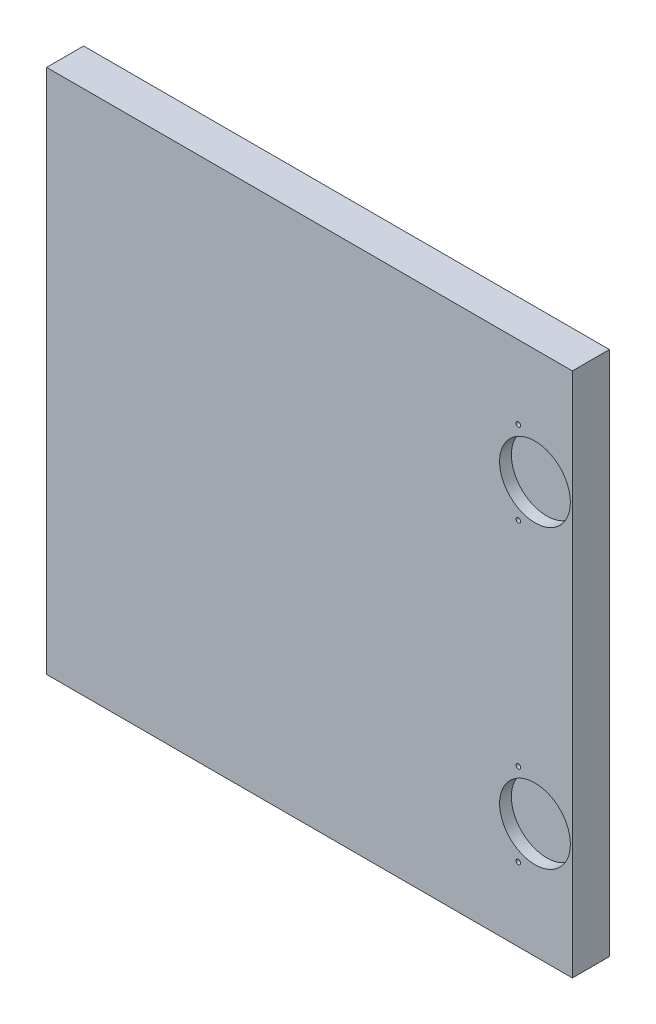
ISO-10303-21;
HEADER;
FILE_DESCRIPTION(('STEP AP214'),'2;1');
FILE_NAME('part.step','',(''),(''),'','','');
FILE_SCHEMA(('AUTOMOTIVE_DESIGN { 1 0 10303 214 1 1 1 1 }'));
ENDSEC;
DATA;
#1=APPLICATION_CONTEXT('core data for automotive mechanical design processes');
#2=APPLICATION_PROTOCOL_DEFINITION('international standard','automotive_design',2000,#1);
#3=PRODUCT_CONTEXT('',#1,'mechanical');
#4=PRODUCT('Part','Part','',(#3));
#5=PRODUCT_RELATED_PRODUCT_CATEGORY('part','',(#4));
#6=PRODUCT_DEFINITION_FORMATION('','',#4);
#7=PRODUCT_DEFINITION_CONTEXT('part definition',#1,'design');
#8=PRODUCT_DEFINITION('design','',#6,#7);
#9=PRODUCT_DEFINITION_SHAPE('','',#8);
#10=(LENGTH_UNIT() NAMED_UNIT(*) SI_UNIT(.MILLI.,.METRE.));
#11=(NAMED_UNIT(*) PLANE_ANGLE_UNIT() SI_UNIT($,.RADIAN.));
#12=(NAMED_UNIT(*) SI_UNIT($,.STERADIAN.) SOLID_ANGLE_UNIT());
#13=UNCERTAINTY_MEASURE_WITH_UNIT(LENGTH_MEASURE(1.E-05),#10,'distance_accuracy_value','');
#14=(GEOMETRIC_REPRESENTATION_CONTEXT(3) GLOBAL_UNCERTAINTY_ASSIGNED_CONTEXT((#13)) GLOBAL_UNIT_ASSIGNED_CONTEXT((#10,
#11,#12)) REPRESENTATION_CONTEXT('',''));
#15=CARTESIAN_POINT('',(0.,0.,0.));
#16=DIRECTION('',(0.,0.,1.));
#17=DIRECTION('',(1.,0.,0.));
#18=AXIS2_PLACEMENT_3D('',#15,#16,#17);
#19=CARTESIAN_POINT('',(0.,0.,0.));
#20=DIRECTION('',(0.,0.,-1.));
#21=DIRECTION('',(-1.,0.,0.));
#22=AXIS2_PLACEMENT_3D('',#19,#20,#21);
#23=PLANE('',#22);
#24=CARTESIAN_POINT('',(121.86,80.,0.));
#25=DIRECTION('',(0.,0.,1.));
#26=DIRECTION('',(1.,0.,0.));
#27=AXIS2_PLACEMENT_3D('',#24,#25,#26);
#28=CIRCLE('',#27,19.125);
#29=CARTESIAN_POINT('',(140.985,80.,0.));
#30=VERTEX_POINT('',#29);
#31=EDGE_CURVE('E39',#30,#30,#28,.T.);
#32=ORIENTED_EDGE('',*,*,#31,.F.);
#33=EDGE_LOOP('',(#32));
#34=FACE_BOUND('',#33,.T.);
#35=CARTESIAN_POINT('',(112.86,57.5765625,0.));
#36=DIRECTION('',(0.,0.,1.));
#37=DIRECTION('',(1.,0.,0.));
#38=AXIS2_PLACEMENT_3D('',#35,#36,#37);
#39=CIRCLE('',#38,1.25);
#40=CARTESIAN_POINT('',(114.11,57.5765625,0.));
#41=VERTEX_POINT('',#40);
#42=EDGE_CURVE('E127',#41,#41,#39,.T.);
#43=ORIENTED_EDGE('',*,*,#42,.F.);
#44=EDGE_LOOP('',(#43));
#45=FACE_BOUND('',#44,.T.);
#46=CARTESIAN_POINT('',(112.86,102.4234375,0.));
#47=DIRECTION('',(0.,0.,1.));
#48=DIRECTION('',(1.,0.,0.));
#49=AXIS2_PLACEMENT_3D('',#46,#47,#48);
#50=CIRCLE('',#49,1.25);
#51=CARTESIAN_POINT('',(114.11,102.4234375,0.));
#52=VERTEX_POINT('',#51);
#53=EDGE_CURVE('E131',#52,#52,#50,.T.);
#54=ORIENTED_EDGE('',*,*,#53,.F.);
#55=EDGE_LOOP('',(#54));
#56=FACE_BOUND('',#55,.T.);
#57=CARTESIAN_POINT('',(121.86,-80.,0.));
#58=DIRECTION('',(0.,0.,-1.));
#59=DIRECTION('',(1.,0.,0.));
#60=AXIS2_PLACEMENT_3D('',#57,#58,#59);
#61=CIRCLE('',#60,19.125);
#62=CARTESIAN_POINT('',(140.985,-80.,0.));
#63=VERTEX_POINT('',#62);
#64=EDGE_CURVE('E121',#63,#63,#61,.T.);
#65=ORIENTED_EDGE('',*,*,#64,.T.);
#66=EDGE_LOOP('',(#65));
#67=FACE_BOUND('',#66,.T.);
#68=CARTESIAN_POINT('',(112.86,-102.4234375,0.));
#69=DIRECTION('',(0.,0.,-1.));
#70=DIRECTION('',(1.,0.,0.));
#71=AXIS2_PLACEMENT_3D('',#68,#69,#70);
#72=CIRCLE('',#71,1.25);
#73=CARTESIAN_POINT('',(114.11,-102.4234375,0.));
#74=VERTEX_POINT('',#73);
#75=EDGE_CURVE('E115',#74,#74,#72,.T.);
#76=ORIENTED_EDGE('',*,*,#75,.T.);
#77=EDGE_LOOP('',(#76));
#78=FACE_BOUND('',#77,.T.);
#79=CARTESIAN_POINT('',(112.86,-57.5765625,0.));
#80=DIRECTION('',(0.,0.,-1.));
#81=DIRECTION('',(1.,0.,0.));
#82=AXIS2_PLACEMENT_3D('',#79,#80,#81);
#83=CIRCLE('',#82,1.25);
#84=CARTESIAN_POINT('',(114.11,-57.5765625,0.));
#85=VERTEX_POINT('',#84);
#86=EDGE_CURVE('E107',#85,#85,#83,.T.);
#87=ORIENTED_EDGE('',*,*,#86,.T.);
#88=EDGE_LOOP('',(#87));
#89=FACE_BOUND('',#88,.T.);
#90=DIRECTION('',(0.,1.,0.));
#91=VECTOR('',#90,1.);
#92=CARTESIAN_POINT('',(-142.0625,-142.0625,0.));
#93=LINE('',#92,#91);
#94=CARTESIAN_POINT('',(-142.0625,-142.0625,0.));
#95=VERTEX_POINT('',#94);
#96=CARTESIAN_POINT('',(-142.0625,142.0625,0.));
#97=VERTEX_POINT('',#96);
#98=EDGE_CURVE('E58',#95,#97,#93,.T.);
#99=ORIENTED_EDGE('',*,*,#98,.F.);
#100=DIRECTION('',(-1.,0.,0.));
#101=VECTOR('',#100,1.);
#102=CARTESIAN_POINT('',(142.0625,-142.0625,0.));
#103=LINE('',#102,#101);
#104=CARTESIAN_POINT('',(142.0625,-142.0625,0.));
#105=VERTEX_POINT('',#104);
#106=EDGE_CURVE('E80',#105,#95,#103,.T.);
#107=ORIENTED_EDGE('',*,*,#106,.F.);
#108=DIRECTION('',(0.,-1.,0.));
#109=VECTOR('',#108,1.);
#110=CARTESIAN_POINT('',(142.0625,142.0625,0.));
#111=LINE('',#110,#109);
#112=CARTESIAN_POINT('',(142.0625,142.0625,0.));
#113=VERTEX_POINT('',#112);
#114=EDGE_CURVE('E87',#113,#105,#111,.T.);
#115=ORIENTED_EDGE('',*,*,#114,.F.);
#116=DIRECTION('',(1.,0.,0.));
#117=VECTOR('',#116,1.);
#118=CARTESIAN_POINT('',(-142.0625,142.0625,0.));
#119=LINE('',#118,#117);
#120=EDGE_CURVE('E92',#97,#113,#119,.T.);
#121=ORIENTED_EDGE('',*,*,#120,.F.);
#122=EDGE_LOOP('',(#99,#107,#115,#121));
#123=FACE_BOUND('',#122,.T.);
#124=ADVANCED_FACE('F36',(#34,#45,#56,#67,#78,#89,#123),#23,.F.);
#125=CARTESIAN_POINT('',(121.86,80.,-6.35));
#126=DIRECTION('',(0.,0.,1.));
#127=DIRECTION('',(1.,0.,0.));
#128=AXIS2_PLACEMENT_3D('',#125,#126,#127);
#129=CYLINDRICAL_SURFACE('',#128,19.125);
#130=CARTESIAN_POINT('',(121.86,80.,-6.35));
#131=DIRECTION('',(0.,0.,1.));
#132=DIRECTION('',(1.,0.,0.));
#133=AXIS2_PLACEMENT_3D('',#130,#131,#132);
#134=CIRCLE('',#133,19.125);
#135=CARTESIAN_POINT('',(140.985,80.,-6.35));
#136=VERTEX_POINT('',#135);
#137=EDGE_CURVE('E12',#136,#136,#134,.T.);
#138=ORIENTED_EDGE('',*,*,#137,.F.);
#139=EDGE_LOOP('',(#138));
#140=FACE_BOUND('',#139,.T.);
#141=ORIENTED_EDGE('',*,*,#31,.T.);
#142=EDGE_LOOP('',(#141));
#143=FACE_BOUND('',#142,.T.);
#144=ADVANCED_FACE('F144',(#140,#143),#129,.F.);
#145=CARTESIAN_POINT('',(121.86,80.,-6.35));
#146=DIRECTION('',(0.,0.,1.));
#147=DIRECTION('',(1.,0.,0.));
#148=AXIS2_PLACEMENT_3D('',#145,#146,#147);
#149=PLANE('',#148);
#150=ORIENTED_EDGE('',*,*,#137,.T.);
#151=EDGE_LOOP('',(#150));
#152=FACE_BOUND('',#151,.T.);
#153=ADVANCED_FACE('F197',(#152),#149,.T.);
#154=CARTESIAN_POINT('',(112.86,57.5765625,-10.));
#155=DIRECTION('',(0.,0.,1.));
#156=DIRECTION('',(1.,0.,0.));
#157=AXIS2_PLACEMENT_3D('',#154,#155,#156);
#158=CYLINDRICAL_SURFACE('',#157,1.25);
#159=CARTESIAN_POINT('',(112.86,57.5765625,-10.));
#160=DIRECTION('',(0.,0.,1.));
#161=DIRECTION('',(1.,0.,0.));
#162=AXIS2_PLACEMENT_3D('',#159,#160,#161);
#163=CIRCLE('',#162,1.25);
#164=CARTESIAN_POINT('',(114.11,57.5765625,-10.));
#165=VERTEX_POINT('',#164);
#166=EDGE_CURVE('E134',#165,#165,#163,.T.);
#167=ORIENTED_EDGE('',*,*,#166,.F.);
#168=EDGE_LOOP('',(#167));
#169=FACE_BOUND('',#168,.T.);
#170=ORIENTED_EDGE('',*,*,#42,.T.);
#171=EDGE_LOOP('',(#170));
#172=FACE_BOUND('',#171,.T.);
#173=ADVANCED_FACE('F140',(#169,#172),#158,.F.);
#174=CARTESIAN_POINT('',(112.86,57.5765625,-10.));
#175=DIRECTION('',(0.,0.,1.));
#176=DIRECTION('',(1.,0.,0.));
#177=AXIS2_PLACEMENT_3D('',#174,#175,#176);
#178=PLANE('',#177);
#179=ORIENTED_EDGE('',*,*,#166,.T.);
#180=EDGE_LOOP('',(#179));
#181=FACE_BOUND('',#180,.T.);
#182=ADVANCED_FACE('F190',(#181),#178,.T.);
#183=CARTESIAN_POINT('',(112.86,102.4234375,-10.));
#184=DIRECTION('',(0.,0.,1.));
#185=DIRECTION('',(1.,0.,0.));
#186=AXIS2_PLACEMENT_3D('',#183,#184,#185);
#187=CYLINDRICAL_SURFACE('',#186,1.25);
#188=CARTESIAN_POINT('',(112.86,102.4234375,-10.));
#189=DIRECTION('',(0.,0.,1.));
#190=DIRECTION('',(1.,0.,0.));
#191=AXIS2_PLACEMENT_3D('',#188,#189,#190);
#192=CIRCLE('',#191,1.25);
#193=CARTESIAN_POINT('',(114.11,102.4234375,-10.));
#194=VERTEX_POINT('',#193);
#195=EDGE_CURVE('E128',#194,#194,#192,.T.);
#196=ORIENTED_EDGE('',*,*,#195,.F.);
#197=EDGE_LOOP('',(#196));
#198=FACE_BOUND('',#197,.T.);
#199=ORIENTED_EDGE('',*,*,#53,.T.);
#200=EDGE_LOOP('',(#199));
#201=FACE_BOUND('',#200,.T.);
#202=ADVANCED_FACE('F186',(#198,#201),#187,.F.);
#203=CARTESIAN_POINT('',(112.86,102.4234375,-10.));
#204=DIRECTION('',(0.,0.,1.));
#205=DIRECTION('',(1.,0.,0.));
#206=AXIS2_PLACEMENT_3D('',#203,#204,#205);
#207=PLANE('',#206);
#208=ORIENTED_EDGE('',*,*,#195,.T.);
#209=EDGE_LOOP('',(#208));
#210=FACE_BOUND('',#209,.T.);
#211=ADVANCED_FACE('F182',(#210),#207,.T.);
#212=CARTESIAN_POINT('',(121.86,-80.,-6.35));
#213=DIRECTION('',(0.,0.,1.));
#214=DIRECTION('',(1.,0.,0.));
#215=AXIS2_PLACEMENT_3D('',#212,#213,#214);
#216=CYLINDRICAL_SURFACE('',#215,19.125);
#217=CARTESIAN_POINT('',(121.86,-80.,-6.35));
#218=DIRECTION('',(0.,0.,-1.));
#219=DIRECTION('',(1.,0.,0.));
#220=AXIS2_PLACEMENT_3D('',#217,#218,#219);
#221=CIRCLE('',#220,19.125);
#222=CARTESIAN_POINT('',(140.985,-80.,-6.35));
#223=VERTEX_POINT('',#222);
#224=EDGE_CURVE('E124',#223,#223,#221,.T.);
#225=ORIENTED_EDGE('',*,*,#224,.T.);
#226=EDGE_LOOP('',(#225));
#227=FACE_BOUND('',#226,.T.);
#228=ORIENTED_EDGE('',*,*,#64,.F.);
#229=EDGE_LOOP('',(#228));
#230=FACE_BOUND('',#229,.T.);
#231=ADVANCED_FACE('F178',(#227,#230),#216,.F.);
#232=CARTESIAN_POINT('',(121.86,-80.,-6.35));
#233=DIRECTION('',(0.,0.,1.));
#234=DIRECTION('',(1.,0.,0.));
#235=AXIS2_PLACEMENT_3D('',#232,#233,#234);
#236=PLANE('',#235);
#237=ORIENTED_EDGE('',*,*,#224,.F.);
#238=EDGE_LOOP('',(#237));
#239=FACE_BOUND('',#238,.T.);
#240=ADVANCED_FACE('F174',(#239),#236,.T.);
#241=CARTESIAN_POINT('',(112.86,-102.4234375,-10.));
#242=DIRECTION('',(0.,0.,1.));
#243=DIRECTION('',(1.,0.,0.));
#244=AXIS2_PLACEMENT_3D('',#241,#242,#243);
#245=CYLINDRICAL_SURFACE('',#244,1.25);
#246=CARTESIAN_POINT('',(112.86,-102.4234375,-10.));
#247=DIRECTION('',(0.,0.,-1.));
#248=DIRECTION('',(1.,0.,0.));
#249=AXIS2_PLACEMENT_3D('',#246,#247,#248);
#250=CIRCLE('',#249,1.25);
#251=CARTESIAN_POINT('',(114.11,-102.4234375,-10.));
#252=VERTEX_POINT('',#251);
#253=EDGE_CURVE('E118',#252,#252,#250,.T.);
#254=ORIENTED_EDGE('',*,*,#253,.T.);
#255=EDGE_LOOP('',(#254));
#256=FACE_BOUND('',#255,.T.);
#257=ORIENTED_EDGE('',*,*,#75,.F.);
#258=EDGE_LOOP('',(#257));
#259=FACE_BOUND('',#258,.T.);
#260=ADVANCED_FACE('F167',(#256,#259),#245,.F.);
#261=CARTESIAN_POINT('',(112.86,-102.4234375,-10.));
#262=DIRECTION('',(0.,0.,1.));
#263=DIRECTION('',(1.,0.,0.));
#264=AXIS2_PLACEMENT_3D('',#261,#262,#263);
#265=PLANE('',#264);
#266=ORIENTED_EDGE('',*,*,#253,.F.);
#267=EDGE_LOOP('',(#266));
#268=FACE_BOUND('',#267,.T.);
#269=ADVANCED_FACE('F157',(#268),#265,.T.);
#270=CARTESIAN_POINT('',(112.86,-57.5765625,-10.));
#271=DIRECTION('',(0.,0.,1.));
#272=DIRECTION('',(1.,0.,0.));
#273=AXIS2_PLACEMENT_3D('',#270,#271,#272);
#274=CYLINDRICAL_SURFACE('',#273,1.25);
#275=CARTESIAN_POINT('',(112.86,-57.5765625,-10.));
#276=DIRECTION('',(0.,0.,-1.));
#277=DIRECTION('',(1.,0.,0.));
#278=AXIS2_PLACEMENT_3D('',#275,#276,#277);
#279=CIRCLE('',#278,1.25);
#280=CARTESIAN_POINT('',(114.11,-57.5765625,-10.));
#281=VERTEX_POINT('',#280);
#282=EDGE_CURVE('E112',#281,#281,#279,.T.);
#283=ORIENTED_EDGE('',*,*,#282,.T.);
#284=EDGE_LOOP('',(#283));
#285=FACE_BOUND('',#284,.T.);
#286=ORIENTED_EDGE('',*,*,#86,.F.);
#287=EDGE_LOOP('',(#286));
#288=FACE_BOUND('',#287,.T.);
#289=ADVANCED_FACE('F154',(#285,#288),#274,.F.);
#290=CARTESIAN_POINT('',(112.86,-57.5765625,-10.));
#291=DIRECTION('',(0.,0.,1.));
#292=DIRECTION('',(1.,0.,0.));
#293=AXIS2_PLACEMENT_3D('',#290,#291,#292);
#294=PLANE('',#293);
#295=ORIENTED_EDGE('',*,*,#282,.F.);
#296=EDGE_LOOP('',(#295));
#297=FACE_BOUND('',#296,.T.);
#298=ADVANCED_FACE('F156',(#297),#294,.T.);
#299=CARTESIAN_POINT('',(-142.0625,-142.0625,0.));
#300=DIRECTION('',(-1.,0.,0.));
#301=DIRECTION('',(0.,0.,1.));
#302=AXIS2_PLACEMENT_3D('',#299,#300,#301);
#303=PLANE('',#302);
#304=DIRECTION('',(0.,1.,0.));
#305=VECTOR('',#304,1.);
#306=CARTESIAN_POINT('',(-142.0625,-142.0625,-20.));
#307=LINE('',#306,#305);
#308=CARTESIAN_POINT('',(-142.0625,-142.0625,-20.));
#309=VERTEX_POINT('',#308);
#310=CARTESIAN_POINT('',(-142.0625,142.0625,-20.));
#311=VERTEX_POINT('',#310);
#312=EDGE_CURVE('E99',#309,#311,#307,.T.);
#313=ORIENTED_EDGE('',*,*,#312,.F.);
#314=DIRECTION('',(0.,0.,-1.));
#315=VECTOR('',#314,1.);
#316=CARTESIAN_POINT('',(-142.0625,-142.0625,0.));
#317=LINE('',#316,#315);
#318=EDGE_CURVE('E83',#95,#309,#317,.T.);
#319=ORIENTED_EDGE('',*,*,#318,.F.);
#320=ORIENTED_EDGE('',*,*,#98,.T.);
#321=DIRECTION('',(0.,0.,-1.));
#322=VECTOR('',#321,1.);
#323=CARTESIAN_POINT('',(-142.0625,142.0625,0.));
#324=LINE('',#323,#322);
#325=EDGE_CURVE('E94',#97,#311,#324,.T.);
#326=ORIENTED_EDGE('',*,*,#325,.T.);
#327=EDGE_LOOP('',(#313,#319,#320,#326));
#328=FACE_BOUND('',#327,.T.);
#329=ADVANCED_FACE('F164',(#328),#303,.T.);
#330=CARTESIAN_POINT('',(142.0625,-142.0625,0.));
#331=DIRECTION('',(0.,-1.,0.));
#332=DIRECTION('',(0.,0.,-1.));
#333=AXIS2_PLACEMENT_3D('',#330,#331,#332);
#334=PLANE('',#333);
#335=DIRECTION('',(-1.,0.,0.));
#336=VECTOR('',#335,1.);
#337=CARTESIAN_POINT('',(142.0625,-142.0625,-20.));
#338=LINE('',#337,#336);
#339=CARTESIAN_POINT('',(142.0625,-142.0625,-20.));
#340=VERTEX_POINT('',#339);
#341=EDGE_CURVE('E82',#340,#309,#338,.T.);
#342=ORIENTED_EDGE('',*,*,#341,.F.);
#343=DIRECTION('',(0.,0.,-1.));
#344=VECTOR('',#343,1.);
#345=CARTESIAN_POINT('',(142.0625,-142.0625,0.));
#346=LINE('',#345,#344);
#347=EDGE_CURVE('E76',#105,#340,#346,.T.);
#348=ORIENTED_EDGE('',*,*,#347,.F.);
#349=ORIENTED_EDGE('',*,*,#106,.T.);
#350=ORIENTED_EDGE('',*,*,#318,.T.);
#351=EDGE_LOOP('',(#342,#348,#349,#350));
#352=FACE_BOUND('',#351,.T.);
#353=ADVANCED_FACE('F78',(#352),#334,.T.);
#354=CARTESIAN_POINT('',(142.0625,142.0625,0.));
#355=DIRECTION('',(1.,0.,0.));
#356=DIRECTION('',(0.,0.,-1.));
#357=AXIS2_PLACEMENT_3D('',#354,#355,#356);
#358=PLANE('',#357);
#359=DIRECTION('',(0.,-1.,0.));
#360=VECTOR('',#359,1.);
#361=CARTESIAN_POINT('',(142.0625,142.0625,-20.));
#362=LINE('',#361,#360);
#363=CARTESIAN_POINT('',(142.0625,142.0625,-20.));
#364=VERTEX_POINT('',#363);
#365=EDGE_CURVE('E50',#364,#340,#362,.T.);
#366=ORIENTED_EDGE('',*,*,#365,.F.);
#367=DIRECTION('',(0.,0.,-1.));
#368=VECTOR('',#367,1.);
#369=CARTESIAN_POINT('',(142.0625,142.0625,0.));
#370=LINE('',#369,#368);
#371=EDGE_CURVE('E84',#113,#364,#370,.T.);
#372=ORIENTED_EDGE('',*,*,#371,.F.);
#373=ORIENTED_EDGE('',*,*,#114,.T.);
#374=ORIENTED_EDGE('',*,*,#347,.T.);
#375=EDGE_LOOP('',(#366,#372,#373,#374));
#376=FACE_BOUND('',#375,.T.);
#377=ADVANCED_FACE('F88',(#376),#358,.T.);
#378=CARTESIAN_POINT('',(-142.0625,142.0625,0.));
#379=DIRECTION('',(0.,1.,0.));
#380=DIRECTION('',(0.,0.,1.));
#381=AXIS2_PLACEMENT_3D('',#378,#379,#380);
#382=PLANE('',#381);
#383=DIRECTION('',(1.,0.,0.));
#384=VECTOR('',#383,1.);
#385=CARTESIAN_POINT('',(-142.0625,142.0625,-20.));
#386=LINE('',#385,#384);
#387=EDGE_CURVE('E102',#311,#364,#386,.T.);
#388=ORIENTED_EDGE('',*,*,#387,.F.);
#389=ORIENTED_EDGE('',*,*,#325,.F.);
#390=ORIENTED_EDGE('',*,*,#120,.T.);
#391=ORIENTED_EDGE('',*,*,#371,.T.);
#392=EDGE_LOOP('',(#388,#389,#390,#391));
#393=FACE_BOUND('',#392,.T.);
#394=ADVANCED_FACE('F206',(#393),#382,.T.);
#395=CARTESIAN_POINT('',(0.,0.,-20.));
#396=DIRECTION('',(0.,0.,-1.));
#397=DIRECTION('',(-1.,0.,0.));
#398=AXIS2_PLACEMENT_3D('',#395,#396,#397);
#399=PLANE('',#398);
#400=ORIENTED_EDGE('',*,*,#341,.T.);
#401=ORIENTED_EDGE('',*,*,#312,.T.);
#402=ORIENTED_EDGE('',*,*,#387,.T.);
#403=ORIENTED_EDGE('',*,*,#365,.T.);
#404=EDGE_LOOP('',(#400,#401,#402,#403));
#405=FACE_BOUND('',#404,.T.);
#406=ADVANCED_FACE('F204',(#405),#399,.T.);
#407=CLOSED_SHELL('',(#124,#144,#153,#173,#182,#202,#211,#231,#240,#260,#269,#289,#298,#329,
#353,#377,#394,#406));
#408=MANIFOLD_SOLID_BREP('B2',#407);
#409=ADVANCED_BREP_SHAPE_REPRESENTATION('',(#18,#408),#14);
#410=SHAPE_DEFINITION_REPRESENTATION(#9,#409);
ENDSEC;
END-ISO-10303-21;
